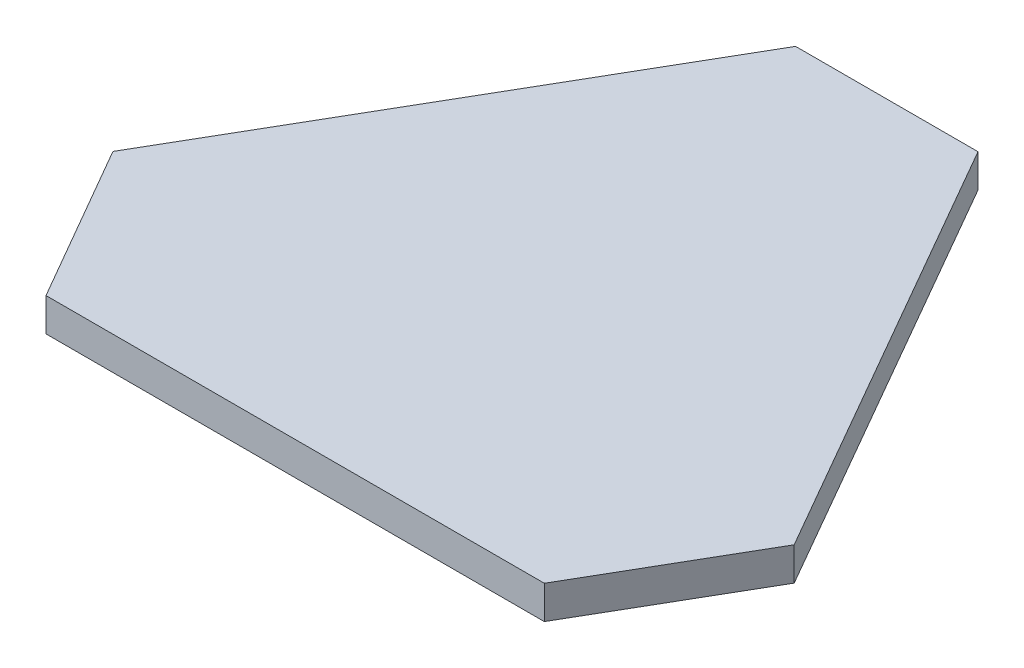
ISO-10303-21;
HEADER;
FILE_DESCRIPTION(('STEP AP214'),'2;1');
FILE_NAME('part.step','',(''),(''),'','','');
FILE_SCHEMA(('AUTOMOTIVE_DESIGN { 1 0 10303 214 1 1 1 1 }'));
ENDSEC;
DATA;
#1=APPLICATION_CONTEXT('core data for automotive mechanical design processes');
#2=APPLICATION_PROTOCOL_DEFINITION('international standard','automotive_design',2000,#1);
#3=PRODUCT_CONTEXT('',#1,'mechanical');
#4=PRODUCT('Part','Part','',(#3));
#5=PRODUCT_RELATED_PRODUCT_CATEGORY('part','',(#4));
#6=PRODUCT_DEFINITION_FORMATION('','',#4);
#7=PRODUCT_DEFINITION_CONTEXT('part definition',#1,'design');
#8=PRODUCT_DEFINITION('design','',#6,#7);
#9=PRODUCT_DEFINITION_SHAPE('','',#8);
#10=(LENGTH_UNIT() NAMED_UNIT(*) SI_UNIT(.MILLI.,.METRE.));
#11=(NAMED_UNIT(*) PLANE_ANGLE_UNIT() SI_UNIT($,.RADIAN.));
#12=(NAMED_UNIT(*) SI_UNIT($,.STERADIAN.) SOLID_ANGLE_UNIT());
#13=UNCERTAINTY_MEASURE_WITH_UNIT(LENGTH_MEASURE(1.E-05),#10,'distance_accuracy_value','');
#14=(GEOMETRIC_REPRESENTATION_CONTEXT(3) GLOBAL_UNCERTAINTY_ASSIGNED_CONTEXT((#13)) GLOBAL_UNIT_ASSIGNED_CONTEXT((#10,
#11,#12)) REPRESENTATION_CONTEXT('',''));
#15=CARTESIAN_POINT('',(0.,0.,0.));
#16=DIRECTION('',(0.,0.,1.));
#17=DIRECTION('',(1.,0.,0.));
#18=AXIS2_PLACEMENT_3D('',#15,#16,#17);
#19=CARTESIAN_POINT('',(-54.2371764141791,20.,-355.613027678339));
#20=DIRECTION('',(0.,0.,-1.));
#21=DIRECTION('',(-1.,0.,0.));
#22=AXIS2_PLACEMENT_3D('',#19,#20,#21);
#23=PLANE('',#22);
#24=DIRECTION('',(1.,0.,0.));
#25=VECTOR('',#24,1.);
#26=CARTESIAN_POINT('',(-54.2371764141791,0.,-355.613027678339));
#27=LINE('',#26,#25);
#28=CARTESIAN_POINT('',(-54.2371764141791,0.,-355.613027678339));
#29=VERTEX_POINT('',#28);
#30=CARTESIAN_POINT('',(55.5843421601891,0.,-355.613027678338));
#31=VERTEX_POINT('',#30);
#32=EDGE_CURVE('E115',#29,#31,#27,.T.);
#33=ORIENTED_EDGE('',*,*,#32,.F.);
#34=DIRECTION('',(0.,-1.,0.));
#35=VECTOR('',#34,1.);
#36=CARTESIAN_POINT('',(-54.2371764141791,20.,-355.613027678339));
#37=LINE('',#36,#35);
#38=CARTESIAN_POINT('',(-54.2371764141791,20.,-355.613027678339));
#39=VERTEX_POINT('',#38);
#40=EDGE_CURVE('E11',#39,#29,#37,.T.);
#41=ORIENTED_EDGE('',*,*,#40,.F.);
#42=DIRECTION('',(1.,0.,0.));
#43=VECTOR('',#42,1.);
#44=CARTESIAN_POINT('',(-54.2371764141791,20.,-355.613027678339));
#45=LINE('',#44,#43);
#46=CARTESIAN_POINT('',(55.5843421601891,20.,-355.613027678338));
#47=VERTEX_POINT('',#46);
#48=EDGE_CURVE('E128',#39,#47,#45,.T.);
#49=ORIENTED_EDGE('',*,*,#48,.T.);
#50=DIRECTION('',(0.,-1.,0.));
#51=VECTOR('',#50,1.);
#52=CARTESIAN_POINT('',(55.5843421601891,20.,-355.613027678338));
#53=LINE('',#52,#51);
#54=EDGE_CURVE('E35',#47,#31,#53,.T.);
#55=ORIENTED_EDGE('',*,*,#54,.T.);
#56=EDGE_LOOP('',(#33,#41,#49,#55));
#57=FACE_BOUND('',#56,.T.);
#58=ADVANCED_FACE('F32',(#57),#23,.T.);
#59=CARTESIAN_POINT('',(-54.2371764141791,20.,-355.613027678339));
#60=DIRECTION('',(0.865353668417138,0.,0.501161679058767));
#61=DIRECTION('',(0.501161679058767,0.,-0.865353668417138));
#62=AXIS2_PLACEMENT_3D('',#59,#60,#61);
#63=PLANE('',#62);
#64=DIRECTION('',(-0.501161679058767,0.,0.865353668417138));
#65=VECTOR('',#64,1.);
#66=CARTESIAN_POINT('',(-54.2371764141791,0.,-355.613027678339));
#67=LINE('',#66,#65);
#68=CARTESIAN_POINT('',(-204.994277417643,0.,-95.3014040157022));
#69=VERTEX_POINT('',#68);
#70=EDGE_CURVE('E127',#29,#69,#67,.T.);
#71=ORIENTED_EDGE('',*,*,#70,.T.);
#72=DIRECTION('',(0.,-1.,0.));
#73=VECTOR('',#72,1.);
#74=CARTESIAN_POINT('',(-204.994277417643,20.,-95.3014040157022));
#75=LINE('',#74,#73);
#76=CARTESIAN_POINT('',(-204.994277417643,20.,-95.3014040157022));
#77=VERTEX_POINT('',#76);
#78=EDGE_CURVE('E41',#77,#69,#75,.T.);
#79=ORIENTED_EDGE('',*,*,#78,.F.);
#80=DIRECTION('',(-0.501161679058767,0.,0.865353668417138));
#81=VECTOR('',#80,1.);
#82=CARTESIAN_POINT('',(-54.2371764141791,20.,-355.613027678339));
#83=LINE('',#82,#81);
#84=EDGE_CURVE('E110',#39,#77,#83,.T.);
#85=ORIENTED_EDGE('',*,*,#84,.F.);
#86=ORIENTED_EDGE('',*,*,#40,.T.);
#87=EDGE_LOOP('',(#71,#79,#85,#86));
#88=FACE_BOUND('',#87,.T.);
#89=ADVANCED_FACE('F138',(#88),#63,.F.);
#90=CARTESIAN_POINT('',(-149.988554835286,20.,0.));
#91=DIRECTION('',(-0.866090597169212,0.,0.499887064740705));
#92=DIRECTION('',(0.499887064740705,0.,0.866090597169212));
#93=AXIS2_PLACEMENT_3D('',#90,#91,#92);
#94=PLANE('',#93);
#95=DIRECTION('',(-0.499887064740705,0.,-0.866090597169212));
#96=VECTOR('',#95,1.);
#97=CARTESIAN_POINT('',(-149.988554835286,0.,0.));
#98=LINE('',#97,#96);
#99=CARTESIAN_POINT('',(-149.988554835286,0.,0.));
#100=VERTEX_POINT('',#99);
#101=EDGE_CURVE('E97',#100,#69,#98,.T.);
#102=ORIENTED_EDGE('',*,*,#101,.F.);
#103=DIRECTION('',(0.,-1.,0.));
#104=VECTOR('',#103,1.);
#105=CARTESIAN_POINT('',(-149.988554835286,20.,0.));
#106=LINE('',#105,#104);
#107=CARTESIAN_POINT('',(-149.988554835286,20.,0.));
#108=VERTEX_POINT('',#107);
#109=EDGE_CURVE('E91',#108,#100,#106,.T.);
#110=ORIENTED_EDGE('',*,*,#109,.F.);
#111=DIRECTION('',(-0.499887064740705,0.,-0.866090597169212));
#112=VECTOR('',#111,1.);
#113=CARTESIAN_POINT('',(-149.988554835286,20.,0.));
#114=LINE('',#113,#112);
#115=EDGE_CURVE('E95',#108,#77,#114,.T.);
#116=ORIENTED_EDGE('',*,*,#115,.T.);
#117=ORIENTED_EDGE('',*,*,#78,.T.);
#118=EDGE_LOOP('',(#102,#110,#116,#117));
#119=FACE_BOUND('',#118,.T.);
#120=ADVANCED_FACE('F93',(#119),#94,.T.);
#121=CARTESIAN_POINT('',(-149.988554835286,20.,0.));
#122=DIRECTION('',(0.,0.,-1.));
#123=DIRECTION('',(-1.,0.,0.));
#124=AXIS2_PLACEMENT_3D('',#121,#122,#123);
#125=PLANE('',#124);
#126=DIRECTION('',(1.,0.,0.));
#127=VECTOR('',#126,1.);
#128=CARTESIAN_POINT('',(-149.988554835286,0.,0.));
#129=LINE('',#128,#127);
#130=CARTESIAN_POINT('',(150.075497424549,0.,0.));
#131=VERTEX_POINT('',#130);
#132=EDGE_CURVE('E124',#100,#131,#129,.T.);
#133=ORIENTED_EDGE('',*,*,#132,.T.);
#134=DIRECTION('',(0.,-1.,0.));
#135=VECTOR('',#134,1.);
#136=CARTESIAN_POINT('',(150.075497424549,20.,0.));
#137=LINE('',#136,#135);
#138=CARTESIAN_POINT('',(150.075497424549,20.,0.));
#139=VERTEX_POINT('',#138);
#140=EDGE_CURVE('E101',#139,#131,#137,.T.);
#141=ORIENTED_EDGE('',*,*,#140,.F.);
#142=DIRECTION('',(1.,0.,0.));
#143=VECTOR('',#142,1.);
#144=CARTESIAN_POINT('',(-149.988554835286,20.,0.));
#145=LINE('',#144,#143);
#146=EDGE_CURVE('E104',#108,#139,#145,.T.);
#147=ORIENTED_EDGE('',*,*,#146,.F.);
#148=ORIENTED_EDGE('',*,*,#109,.T.);
#149=EDGE_LOOP('',(#133,#141,#147,#148));
#150=FACE_BOUND('',#149,.T.);
#151=ADVANCED_FACE('F105',(#150),#125,.F.);
#152=CARTESIAN_POINT('',(205.21826345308,20.,-95.3014040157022));
#153=DIRECTION('',(0.865551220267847,0.,0.500820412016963));
#154=DIRECTION('',(0.500820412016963,0.,-0.865551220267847));
#155=AXIS2_PLACEMENT_3D('',#152,#153,#154);
#156=PLANE('',#155);
#157=DIRECTION('',(-0.500820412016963,0.,0.865551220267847));
#158=VECTOR('',#157,1.);
#159=CARTESIAN_POINT('',(205.21826345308,0.,-95.3014040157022));
#160=LINE('',#159,#158);
#161=CARTESIAN_POINT('',(205.21826345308,0.,-95.3014040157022));
#162=VERTEX_POINT('',#161);
#163=EDGE_CURVE('E121',#162,#131,#160,.T.);
#164=ORIENTED_EDGE('',*,*,#163,.F.);
#165=DIRECTION('',(0.,-1.,0.));
#166=VECTOR('',#165,1.);
#167=CARTESIAN_POINT('',(205.21826345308,20.,-95.3014040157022));
#168=LINE('',#167,#166);
#169=CARTESIAN_POINT('',(205.21826345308,20.,-95.3014040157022));
#170=VERTEX_POINT('',#169);
#171=EDGE_CURVE('E131',#170,#162,#168,.T.);
#172=ORIENTED_EDGE('',*,*,#171,.F.);
#173=DIRECTION('',(-0.500820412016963,0.,0.865551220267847));
#174=VECTOR('',#173,1.);
#175=CARTESIAN_POINT('',(205.21826345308,20.,-95.3014040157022));
#176=LINE('',#175,#174);
#177=EDGE_CURVE('E107',#170,#139,#176,.T.);
#178=ORIENTED_EDGE('',*,*,#177,.T.);
#179=ORIENTED_EDGE('',*,*,#140,.T.);
#180=EDGE_LOOP('',(#164,#172,#178,#179));
#181=FACE_BOUND('',#180,.T.);
#182=ADVANCED_FACE('F142',(#181),#156,.T.);
#183=CARTESIAN_POINT('',(205.21826345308,20.,-95.3014040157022));
#184=DIRECTION('',(-0.866971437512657,0.,0.498357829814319));
#185=DIRECTION('',(0.498357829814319,0.,0.866971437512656));
#186=AXIS2_PLACEMENT_3D('',#183,#184,#185);
#187=PLANE('',#186);
#188=DIRECTION('',(-0.498357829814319,0.,-0.866971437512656));
#189=VECTOR('',#188,1.);
#190=CARTESIAN_POINT('',(205.21826345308,0.,-95.3014040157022));
#191=LINE('',#190,#189);
#192=EDGE_CURVE('E118',#162,#31,#191,.T.);
#193=ORIENTED_EDGE('',*,*,#192,.T.);
#194=ORIENTED_EDGE('',*,*,#54,.F.);
#195=DIRECTION('',(-0.498357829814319,0.,-0.866971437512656));
#196=VECTOR('',#195,1.);
#197=CARTESIAN_POINT('',(205.21826345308,20.,-95.3014040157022));
#198=LINE('',#197,#196);
#199=EDGE_CURVE('E83',#170,#47,#198,.T.);
#200=ORIENTED_EDGE('',*,*,#199,.F.);
#201=ORIENTED_EDGE('',*,*,#171,.T.);
#202=EDGE_LOOP('',(#193,#194,#200,#201));
#203=FACE_BOUND('',#202,.T.);
#204=ADVANCED_FACE('F134',(#203),#187,.F.);
#205=CARTESIAN_POINT('',(0.,20.,0.));
#206=DIRECTION('',(0.,1.,0.));
#207=DIRECTION('',(0.,0.,1.));
#208=AXIS2_PLACEMENT_3D('',#205,#206,#207);
#209=PLANE('',#208);
#210=ORIENTED_EDGE('',*,*,#48,.F.);
#211=ORIENTED_EDGE('',*,*,#84,.T.);
#212=ORIENTED_EDGE('',*,*,#115,.F.);
#213=ORIENTED_EDGE('',*,*,#146,.T.);
#214=ORIENTED_EDGE('',*,*,#177,.F.);
#215=ORIENTED_EDGE('',*,*,#199,.T.);
#216=EDGE_LOOP('',(#210,#211,#212,#213,#214,#215));
#217=FACE_BOUND('',#216,.T.);
#218=ADVANCED_FACE('F109',(#217),#209,.T.);
#219=CARTESIAN_POINT('',(0.,0.,0.));
#220=DIRECTION('',(0.,1.,0.));
#221=DIRECTION('',(0.,0.,1.));
#222=AXIS2_PLACEMENT_3D('',#219,#220,#221);
#223=PLANE('',#222);
#224=ORIENTED_EDGE('',*,*,#32,.T.);
#225=ORIENTED_EDGE('',*,*,#192,.F.);
#226=ORIENTED_EDGE('',*,*,#163,.T.);
#227=ORIENTED_EDGE('',*,*,#132,.F.);
#228=ORIENTED_EDGE('',*,*,#101,.T.);
#229=ORIENTED_EDGE('',*,*,#70,.F.);
#230=EDGE_LOOP('',(#224,#225,#226,#227,#228,#229));
#231=FACE_BOUND('',#230,.T.);
#232=ADVANCED_FACE('F137',(#231),#223,.F.);
#233=CLOSED_SHELL('',(#58,#89,#120,#151,#182,#204,#218,#232));
#234=MANIFOLD_SOLID_BREP('B2',#233);
#235=ADVANCED_BREP_SHAPE_REPRESENTATION('',(#18,#234),#14);
#236=SHAPE_DEFINITION_REPRESENTATION(#9,#235);
ENDSEC;
END-ISO-10303-21;
